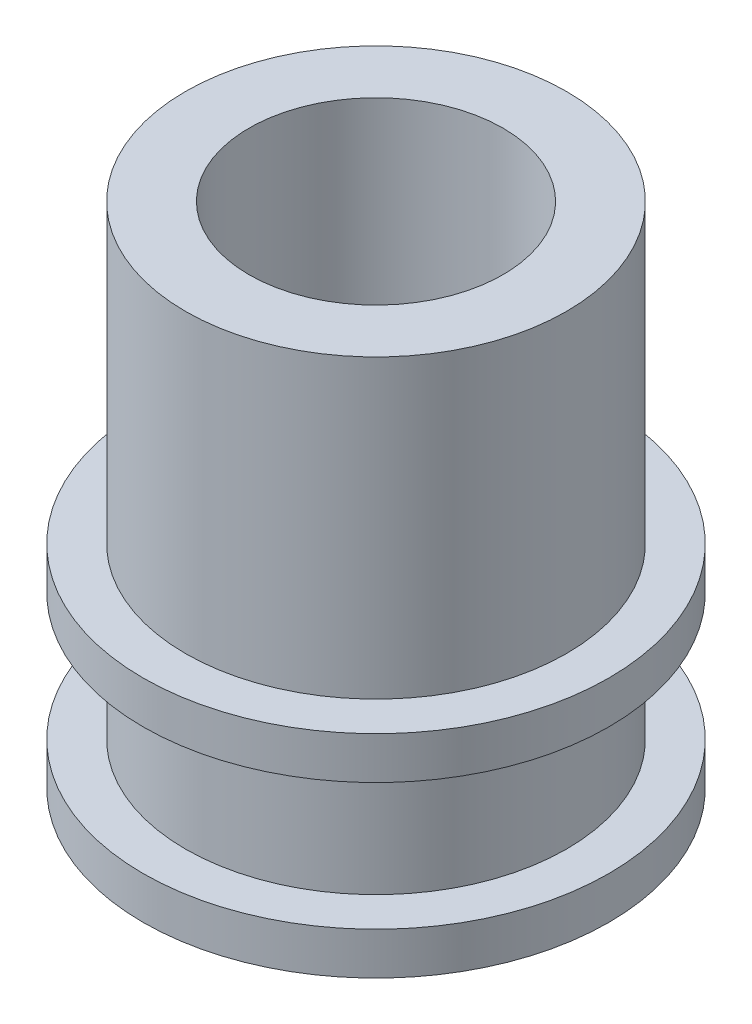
from build123d import *


with BuildPart() as part:
    # Esquisse1 → Base-R_volution (revolve)
    with BuildSketch(Plane.XY, mode=Mode.PRIVATE) as base_r_volution_sk:
        Polygon((-3, 12), (-3, 0), (-5.5, 0), (-5.5, 1), (-4.5, 1), (-4.5, 4), (-5.5, 4), (-5.5, 5), (-4.5, 5), (-4.5, 12), align=None)
    revolve(base_r_volution_sk.sketch.rotate(Axis((0, 0, 0), (0, 1, 0)), 270), axis=Axis((0, 0, 0), (0, 1, 0)))


solid = part.part
